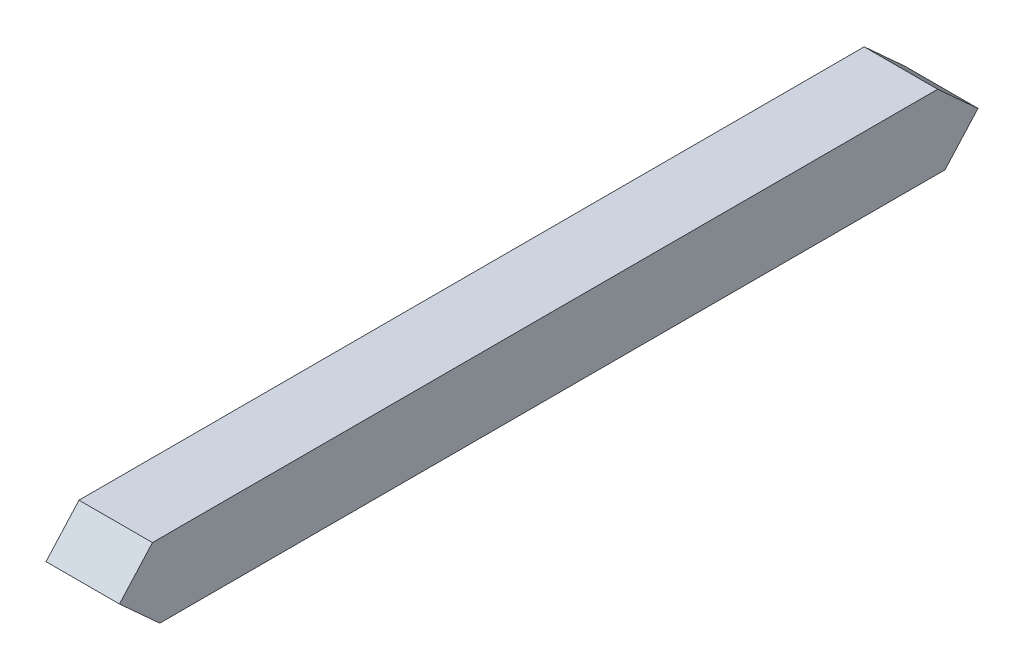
ISO-10303-21;
HEADER;
FILE_DESCRIPTION(('STEP AP214'),'2;1');
FILE_NAME('part.step','',(''),(''),'','','');
FILE_SCHEMA(('AUTOMOTIVE_DESIGN { 1 0 10303 214 1 1 1 1 }'));
ENDSEC;
DATA;
#1=APPLICATION_CONTEXT('core data for automotive mechanical design processes');
#2=APPLICATION_PROTOCOL_DEFINITION('international standard','automotive_design',2000,#1);
#3=PRODUCT_CONTEXT('',#1,'mechanical');
#4=PRODUCT('Part','Part','',(#3));
#5=PRODUCT_RELATED_PRODUCT_CATEGORY('part','',(#4));
#6=PRODUCT_DEFINITION_FORMATION('','',#4);
#7=PRODUCT_DEFINITION_CONTEXT('part definition',#1,'design');
#8=PRODUCT_DEFINITION('design','',#6,#7);
#9=PRODUCT_DEFINITION_SHAPE('','',#8);
#10=(LENGTH_UNIT() NAMED_UNIT(*) SI_UNIT(.MILLI.,.METRE.));
#11=(NAMED_UNIT(*) PLANE_ANGLE_UNIT() SI_UNIT($,.RADIAN.));
#12=(NAMED_UNIT(*) SI_UNIT($,.STERADIAN.) SOLID_ANGLE_UNIT());
#13=UNCERTAINTY_MEASURE_WITH_UNIT(LENGTH_MEASURE(1.E-05),#10,'distance_accuracy_value','');
#14=(GEOMETRIC_REPRESENTATION_CONTEXT(3) GLOBAL_UNCERTAINTY_ASSIGNED_CONTEXT((#13)) GLOBAL_UNIT_ASSIGNED_CONTEXT((#10,
#11,#12)) REPRESENTATION_CONTEXT('',''));
#15=CARTESIAN_POINT('',(0.,0.,0.));
#16=DIRECTION('',(0.,0.,1.));
#17=DIRECTION('',(1.,0.,0.));
#18=AXIS2_PLACEMENT_3D('',#15,#16,#17);
#19=CARTESIAN_POINT('',(33.5,33.5,783.));
#20=DIRECTION('',(-1.,0.,0.));
#21=DIRECTION('',(0.,-1.,0.));
#22=AXIS2_PLACEMENT_3D('',#19,#20,#21);
#23=PLANE('',#22);
#24=DIRECTION('',(0.,0.,-1.));
#25=VECTOR('',#24,1.);
#26=CARTESIAN_POINT('',(33.5,-33.5,783.));
#27=LINE('',#26,#25);
#28=CARTESIAN_POINT('',(33.5,-33.5,746.22197502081));
#29=VERTEX_POINT('',#28);
#30=CARTESIAN_POINT('',(33.5,-33.4999999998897,30.0859620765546));
#31=VERTEX_POINT('',#30);
#32=EDGE_CURVE('E182',#29,#31,#27,.T.);
#33=ORIENTED_EDGE('',*,*,#32,.T.);
#34=DIRECTION('',(0.,-0.744000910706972,0.668178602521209));
#35=VECTOR('',#34,1.);
#36=CARTESIAN_POINT('',(33.5,1.10127373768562E-10,-1.12132525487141E-11));
#37=LINE('',#36,#35);
#38=CARTESIAN_POINT('',(33.5,1.10127373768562E-10,-1.12132525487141E-11));
#39=VERTEX_POINT('',#38);
#40=EDGE_CURVE('E166',#39,#31,#37,.T.);
#41=ORIENTED_EDGE('',*,*,#40,.F.);
#42=DIRECTION('',(0.,0.673392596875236,0.739285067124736));
#43=VECTOR('',#42,1.);
#44=CARTESIAN_POINT('',(33.5,1.10127373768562E-10,-1.12132525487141E-11));
#45=LINE('',#44,#43);
#46=CARTESIAN_POINT('',(33.5,33.5000000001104,36.7780249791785));
#47=VERTEX_POINT('',#46);
#48=EDGE_CURVE('E194',#39,#47,#45,.T.);
#49=ORIENTED_EDGE('',*,*,#48,.T.);
#50=DIRECTION('',(0.,0.,-1.));
#51=VECTOR('',#50,1.);
#52=CARTESIAN_POINT('',(33.5,33.5,783.));
#53=LINE('',#52,#51);
#54=CARTESIAN_POINT('',(33.5,33.5,752.914037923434));
#55=VERTEX_POINT('',#54);
#56=EDGE_CURVE('E12',#55,#47,#53,.T.);
#57=ORIENTED_EDGE('',*,*,#56,.F.);
#58=DIRECTION('',(0.,0.744000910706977,-0.668178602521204));
#59=VECTOR('',#58,1.);
#60=CARTESIAN_POINT('',(33.5,0.,783.));
#61=LINE('',#60,#59);
#62=CARTESIAN_POINT('',(33.5,0.,783.));
#63=VERTEX_POINT('',#62);
#64=EDGE_CURVE('E138',#63,#55,#61,.T.);
#65=ORIENTED_EDGE('',*,*,#64,.F.);
#66=DIRECTION('',(0.,-0.673392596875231,-0.739285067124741));
#67=VECTOR('',#66,1.);
#68=CARTESIAN_POINT('',(33.5,0.,783.));
#69=LINE('',#68,#67);
#70=EDGE_CURVE('E189',#63,#29,#69,.T.);
#71=ORIENTED_EDGE('',*,*,#70,.T.);
#72=EDGE_LOOP('',(#33,#41,#49,#57,#65,#71));
#73=FACE_BOUND('',#72,.T.);
#74=ADVANCED_FACE('F104',(#73),#23,.F.);
#75=CARTESIAN_POINT('',(-33.5,33.5,783.));
#76=DIRECTION('',(1.,0.,0.));
#77=DIRECTION('',(0.,1.,0.));
#78=AXIS2_PLACEMENT_3D('',#75,#76,#77);
#79=PLANE('',#78);
#80=DIRECTION('',(0.,0.673392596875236,0.739285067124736));
#81=VECTOR('',#80,1.);
#82=CARTESIAN_POINT('',(-33.5,1.10127373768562E-10,-1.12132525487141E-11));
#83=LINE('',#82,#81);
#84=CARTESIAN_POINT('',(-33.5,1.10127373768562E-10,-1.12132525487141E-11));
#85=VERTEX_POINT('',#84);
#86=CARTESIAN_POINT('',(-33.5,33.5000000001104,36.7780249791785));
#87=VERTEX_POINT('',#86);
#88=EDGE_CURVE('E179',#85,#87,#83,.T.);
#89=ORIENTED_EDGE('',*,*,#88,.F.);
#90=DIRECTION('',(0.,-0.744000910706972,0.668178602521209));
#91=VECTOR('',#90,1.);
#92=CARTESIAN_POINT('',(-33.5,1.10127373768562E-10,-1.12132525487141E-11));
#93=LINE('',#92,#91);
#94=CARTESIAN_POINT('',(-33.5,-33.4999999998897,30.0859620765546));
#95=VERTEX_POINT('',#94);
#96=EDGE_CURVE('E163',#85,#95,#93,.T.);
#97=ORIENTED_EDGE('',*,*,#96,.T.);
#98=DIRECTION('',(0.,0.,-1.));
#99=VECTOR('',#98,1.);
#100=CARTESIAN_POINT('',(-33.5,-33.5,783.));
#101=LINE('',#100,#99);
#102=CARTESIAN_POINT('',(-33.5,-33.5,746.22197502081));
#103=VERTEX_POINT('',#102);
#104=EDGE_CURVE('E177',#103,#95,#101,.T.);
#105=ORIENTED_EDGE('',*,*,#104,.F.);
#106=DIRECTION('',(0.,-0.673392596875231,-0.739285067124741));
#107=VECTOR('',#106,1.);
#108=CARTESIAN_POINT('',(-33.5,0.,783.));
#109=LINE('',#108,#107);
#110=CARTESIAN_POINT('',(-33.5,0.,783.));
#111=VERTEX_POINT('',#110);
#112=EDGE_CURVE('E187',#111,#103,#109,.T.);
#113=ORIENTED_EDGE('',*,*,#112,.F.);
#114=DIRECTION('',(0.,0.744000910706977,-0.668178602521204));
#115=VECTOR('',#114,1.);
#116=CARTESIAN_POINT('',(-33.5,0.,783.));
#117=LINE('',#116,#115);
#118=CARTESIAN_POINT('',(-33.5,33.5,752.914037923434));
#119=VERTEX_POINT('',#118);
#120=EDGE_CURVE('E119',#111,#119,#117,.T.);
#121=ORIENTED_EDGE('',*,*,#120,.T.);
#122=DIRECTION('',(0.,0.,-1.));
#123=VECTOR('',#122,1.);
#124=CARTESIAN_POINT('',(-33.5,33.5,783.));
#125=LINE('',#124,#123);
#126=EDGE_CURVE('E112',#119,#87,#125,.T.);
#127=ORIENTED_EDGE('',*,*,#126,.T.);
#128=EDGE_LOOP('',(#89,#97,#105,#113,#121,#127));
#129=FACE_BOUND('',#128,.T.);
#130=ADVANCED_FACE('F175',(#129),#79,.F.);
#131=CARTESIAN_POINT('',(-33.5,33.5,783.));
#132=DIRECTION('',(0.,-1.,0.));
#133=DIRECTION('',(0.,0.,-1.));
#134=AXIS2_PLACEMENT_3D('',#131,#132,#133);
#135=PLANE('',#134);
#136=DIRECTION('',(1.,0.,0.));
#137=VECTOR('',#136,1.);
#138=CARTESIAN_POINT('',(-33.5,33.5000000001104,36.7780249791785));
#139=LINE('',#138,#137);
#140=EDGE_CURVE('E199',#87,#47,#139,.T.);
#141=ORIENTED_EDGE('',*,*,#140,.F.);
#142=ORIENTED_EDGE('',*,*,#126,.F.);
#143=DIRECTION('',(1.,0.,0.));
#144=VECTOR('',#143,1.);
#145=CARTESIAN_POINT('',(-33.5,33.5,752.914037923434));
#146=LINE('',#145,#144);
#147=EDGE_CURVE('E192',#119,#55,#146,.T.);
#148=ORIENTED_EDGE('',*,*,#147,.T.);
#149=ORIENTED_EDGE('',*,*,#56,.T.);
#150=EDGE_LOOP('',(#141,#142,#148,#149));
#151=FACE_BOUND('',#150,.T.);
#152=ADVANCED_FACE('F212',(#151),#135,.F.);
#153=CARTESIAN_POINT('',(-33.5,-33.5,783.));
#154=DIRECTION('',(0.,1.,0.));
#155=DIRECTION('',(0.,0.,1.));
#156=AXIS2_PLACEMENT_3D('',#153,#154,#155);
#157=PLANE('',#156);
#158=ORIENTED_EDGE('',*,*,#104,.T.);
#159=DIRECTION('',(1.,0.,0.));
#160=VECTOR('',#159,1.);
#161=CARTESIAN_POINT('',(-33.5,-33.4999999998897,30.0859620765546));
#162=LINE('',#161,#160);
#163=EDGE_CURVE('E160',#95,#31,#162,.T.);
#164=ORIENTED_EDGE('',*,*,#163,.T.);
#165=ORIENTED_EDGE('',*,*,#32,.F.);
#166=DIRECTION('',(1.,0.,0.));
#167=VECTOR('',#166,1.);
#168=CARTESIAN_POINT('',(-33.5,-33.5,746.22197502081));
#169=LINE('',#168,#167);
#170=EDGE_CURVE('E130',#103,#29,#169,.T.);
#171=ORIENTED_EDGE('',*,*,#170,.F.);
#172=EDGE_LOOP('',(#158,#164,#165,#171));
#173=FACE_BOUND('',#172,.T.);
#174=ADVANCED_FACE('F181',(#173),#157,.F.);
#175=CARTESIAN_POINT('',(-33.5,0.,783.));
#176=DIRECTION('',(0.,-0.739285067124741,0.673392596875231));
#177=DIRECTION('',(0.,-0.673392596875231,-0.739285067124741));
#178=AXIS2_PLACEMENT_3D('',#175,#176,#177);
#179=PLANE('',#178);
#180=DIRECTION('',(1.,0.,0.));
#181=VECTOR('',#180,1.);
#182=CARTESIAN_POINT('',(-33.5,0.,783.));
#183=LINE('',#182,#181);
#184=EDGE_CURVE('E134',#111,#63,#183,.T.);
#185=ORIENTED_EDGE('',*,*,#184,.F.);
#186=ORIENTED_EDGE('',*,*,#112,.T.);
#187=ORIENTED_EDGE('',*,*,#170,.T.);
#188=ORIENTED_EDGE('',*,*,#70,.F.);
#189=EDGE_LOOP('',(#185,#186,#187,#188));
#190=FACE_BOUND('',#189,.T.);
#191=ADVANCED_FACE('F214',(#190),#179,.T.);
#192=CARTESIAN_POINT('',(-33.5,0.,783.));
#193=DIRECTION('',(0.,-0.668178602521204,-0.744000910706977));
#194=DIRECTION('',(0.,0.744000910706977,-0.668178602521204));
#195=AXIS2_PLACEMENT_3D('',#192,#193,#194);
#196=PLANE('',#195);
#197=ORIENTED_EDGE('',*,*,#147,.F.);
#198=ORIENTED_EDGE('',*,*,#120,.F.);
#199=ORIENTED_EDGE('',*,*,#184,.T.);
#200=ORIENTED_EDGE('',*,*,#64,.T.);
#201=EDGE_LOOP('',(#197,#198,#199,#200));
#202=FACE_BOUND('',#201,.T.);
#203=ADVANCED_FACE('F213',(#202),#196,.F.);
#204=CARTESIAN_POINT('',(-33.5,1.10127373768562E-10,-1.12132525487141E-11));
#205=DIRECTION('',(0.,0.739285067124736,-0.673392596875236));
#206=DIRECTION('',(0.,0.673392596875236,0.739285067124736));
#207=AXIS2_PLACEMENT_3D('',#204,#205,#206);
#208=PLANE('',#207);
#209=DIRECTION('',(1.,0.,0.));
#210=VECTOR('',#209,1.);
#211=CARTESIAN_POINT('',(-33.5,1.10127373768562E-10,-1.12132525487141E-11));
#212=LINE('',#211,#210);
#213=EDGE_CURVE('E197',#85,#39,#212,.T.);
#214=ORIENTED_EDGE('',*,*,#213,.F.);
#215=ORIENTED_EDGE('',*,*,#88,.T.);
#216=ORIENTED_EDGE('',*,*,#140,.T.);
#217=ORIENTED_EDGE('',*,*,#48,.F.);
#218=EDGE_LOOP('',(#214,#215,#216,#217));
#219=FACE_BOUND('',#218,.T.);
#220=ADVANCED_FACE('F207',(#219),#208,.T.);
#221=CARTESIAN_POINT('',(-33.5,1.10127373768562E-10,-1.12132525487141E-11));
#222=DIRECTION('',(0.,0.668178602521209,0.744000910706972));
#223=DIRECTION('',(0.,-0.744000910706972,0.668178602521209));
#224=AXIS2_PLACEMENT_3D('',#221,#222,#223);
#225=PLANE('',#224);
#226=ORIENTED_EDGE('',*,*,#163,.F.);
#227=ORIENTED_EDGE('',*,*,#96,.F.);
#228=ORIENTED_EDGE('',*,*,#213,.T.);
#229=ORIENTED_EDGE('',*,*,#40,.T.);
#230=EDGE_LOOP('',(#226,#227,#228,#229));
#231=FACE_BOUND('',#230,.T.);
#232=ADVANCED_FACE('F162',(#231),#225,.F.);
#233=CLOSED_SHELL('',(#74,#130,#152,#174,#191,#203,#220,#232));
#234=MANIFOLD_SOLID_BREP('B2',#233);
#235=ADVANCED_BREP_SHAPE_REPRESENTATION('',(#18,#234),#14);
#236=SHAPE_DEFINITION_REPRESENTATION(#9,#235);
ENDSEC;
END-ISO-10303-21;
